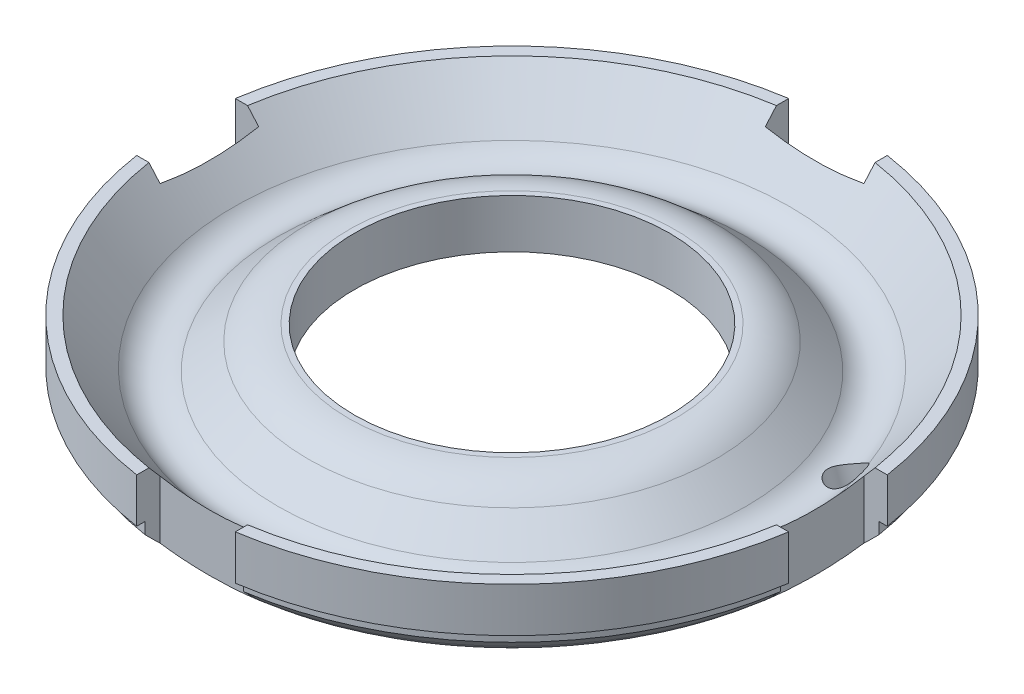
from build123d import *

# Parameters (mm, degrees)
SKETCH2_W          = 3.556
SKETCH2_H          = 12.954
SKETCH2_W_2        = 12.954
SKETCH2_H_2        = 3.556
CUT_EXTRUDE1_DEPTH = 63.393128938


with BuildPart() as part:
    # Sketch1 → Revolve1 (revolve)
    with BuildSketch(Plane.XY, mode=Mode.PRIVATE) as revolve1_sk:
        with BuildLine():
            Line((-43.307, 0), (-41.7195, 0))
            Line((-41.7195, 0), (-36.56543063, -5.972459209))
            ThreePointArc((-36.56543063, -5.972459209), (-33.734707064, -7.396579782), (-30.72607792, -6.401961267))
            Line((-30.72607792, -6.401961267), (-26.772953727, -2.990522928))
            ThreePointArc((-26.772953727, -2.990522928), (-24.29541887, -1.525606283), (-21.462670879, -1.016))
            Line((-21.462670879, -1.016), (-20.701, -1.016))
            Line((-20.701, -1.016), (-20.701, -7.432546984))
            Line((-20.701, -7.432546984), (-23.166626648, -7.432546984))
            ThreePointArc((-23.166626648, -7.432546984), (-24.284449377, -7.627510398), (-25.27027057, -8.189377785))
            Line((-25.27027057, -8.189377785), (-26.943383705, -9.572246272))
            ThreePointArc((-26.943383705, -9.572246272), (-33.947903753, -11.900379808), (-40.691448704, -8.89902872))
            Line((-40.691448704, -8.89902872), (-42.2148, -7.366))
            Line((-42.2148, -7.366), (-42.2148, -5.842))
            Line((-42.2148, -5.842), (-43.307, -5.842))
            Line((-43.307, -5.842), (-43.307, 0))
        make_face()
    revolve(revolve1_sk.sketch.rotate(Axis((0, 0, 0), (0, -1, 0)), 270), axis=Axis((0, 0, 0), (0, -1, 0)))

    # Sketch2 → Cut-Extrude1 (cut, through all)
    with BuildSketch(Plane(origin=(0, 0, 0), x_dir=(1, 0, 0), z_dir=(0, 1, 0))):
        with Locations((41.529, 0)):
            Rectangle(SKETCH2_W, SKETCH2_H)
        with Locations((0, 41.529)):
            Rectangle(SKETCH2_W_2, SKETCH2_H_2)
        with Locations((0, -41.529)):
            Rectangle(SKETCH2_W_2, SKETCH2_H_2)
        with Locations((-41.529, 0)):
            Rectangle(SKETCH2_W, SKETCH2_H)
    extrude(amount=-CUT_EXTRUDE1_DEPTH, mode=Mode.SUBTRACT)

    # Sketch3 → Cut-Revolve1 (revolve, cut)
    with BuildSketch(Plane(origin=(0, 0, 0), x_dir=(0.9510565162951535, 0, -0.30901699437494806), z_dir=(0.30901699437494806, 0, 0.9510565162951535)), mode=Mode.PRIVATE) as cut_revolve1_sk:
        Polygon((31.815957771, 4.403246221), (29.595584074, 3.808298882), (35.986668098, -20.043551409), (38.207041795, -19.448604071), align=None)
    revolve(cut_revolve1_sk.sketch.rotate(Axis((0, 123.142017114, 0), (0.24615153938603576, -0.96592582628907, -0.07997948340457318)), 71.266172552), axis=Axis((0, 123.142017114, 0), (0.24615153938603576, -0.96592582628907, -0.07997948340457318)), mode=Mode.SUBTRACT)


solid = part.part
